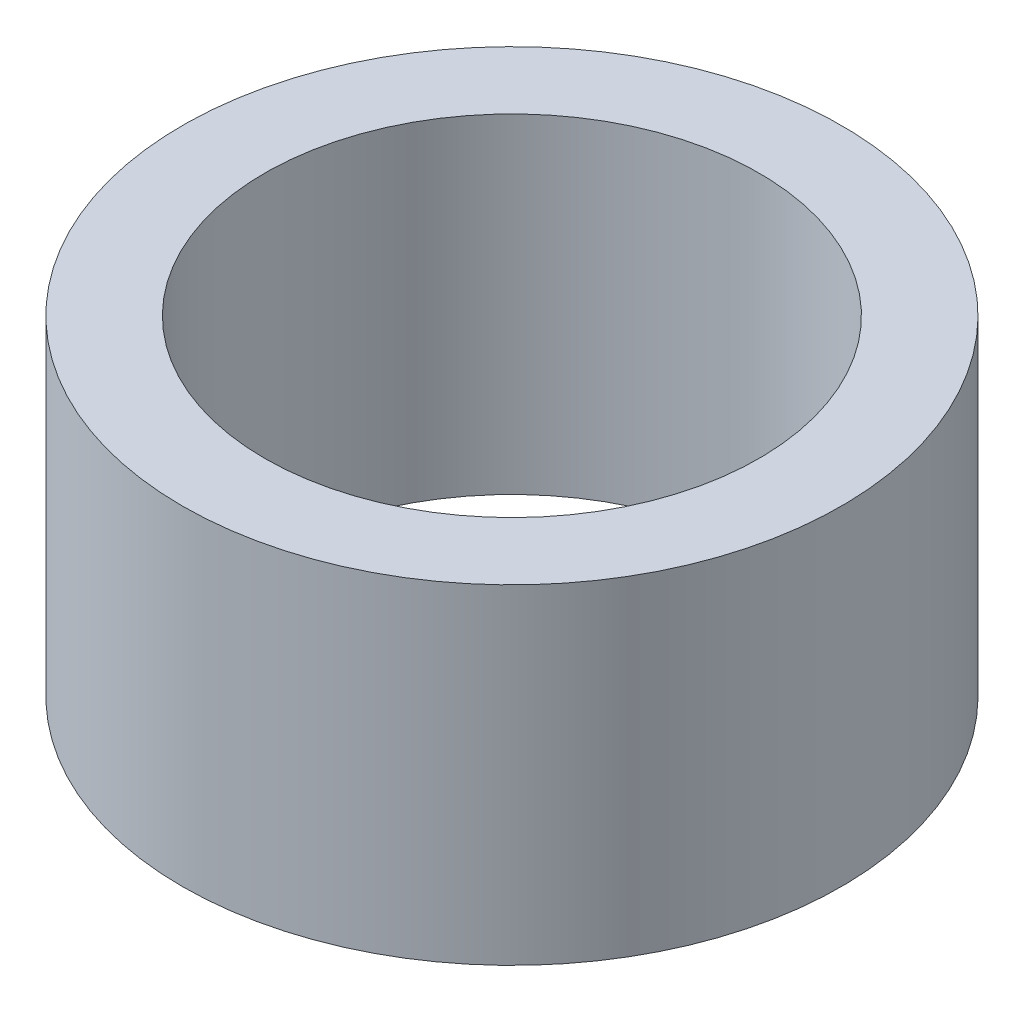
from build123d import *

# Parameters (mm, degrees)
SKETCH_1_R      = 12
SKETCH_1_R_2    = 9
EXTRUDE_1_DEPTH = 6


with BuildPart() as part:
    # Sketch 1 → Extrude 1 (new, symmetric)
    with BuildSketch(Plane(origin=(0, 0, 0), x_dir=(1, 0, 0), z_dir=(0, 1, 0))):
        with Locations(Location((0, 0, 0), (0, 0, 270))):
            Circle(SKETCH_1_R)
        with Locations(Location((0, 0, 0), (0, 0, 270))):
            Circle(SKETCH_1_R_2, mode=Mode.SUBTRACT)
    extrude(amount=EXTRUDE_1_DEPTH, both=True)


solid = part.part
